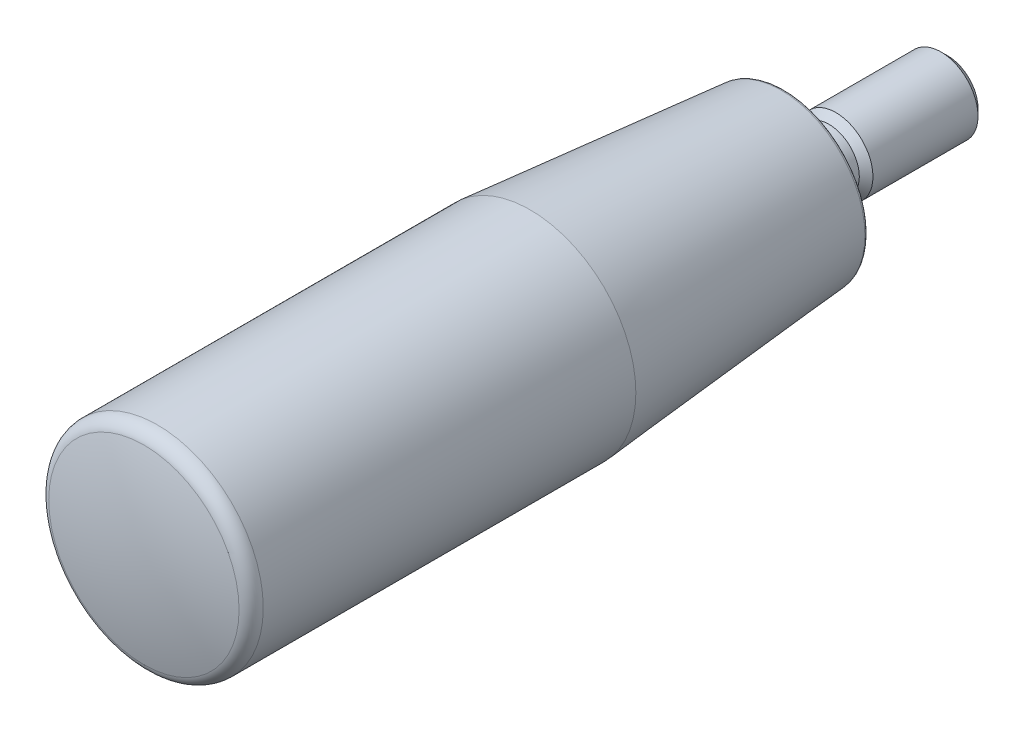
ISO-10303-21;
HEADER;
FILE_DESCRIPTION(('STEP AP214'),'2;1');
FILE_NAME('part.step','',(''),(''),'','','');
FILE_SCHEMA(('AUTOMOTIVE_DESIGN { 1 0 10303 214 1 1 1 1 }'));
ENDSEC;
DATA;
#1=APPLICATION_CONTEXT('core data for automotive mechanical design processes');
#2=APPLICATION_PROTOCOL_DEFINITION('international standard','automotive_design',2000,#1);
#3=PRODUCT_CONTEXT('',#1,'mechanical');
#4=PRODUCT('Part','Part','',(#3));
#5=PRODUCT_RELATED_PRODUCT_CATEGORY('part','',(#4));
#6=PRODUCT_DEFINITION_FORMATION('','',#4);
#7=PRODUCT_DEFINITION_CONTEXT('part definition',#1,'design');
#8=PRODUCT_DEFINITION('design','',#6,#7);
#9=PRODUCT_DEFINITION_SHAPE('','',#8);
#10=(LENGTH_UNIT() NAMED_UNIT(*) SI_UNIT(.MILLI.,.METRE.));
#11=(NAMED_UNIT(*) PLANE_ANGLE_UNIT() SI_UNIT($,.RADIAN.));
#12=(NAMED_UNIT(*) SI_UNIT($,.STERADIAN.) SOLID_ANGLE_UNIT());
#13=UNCERTAINTY_MEASURE_WITH_UNIT(LENGTH_MEASURE(1.E-05),#10,'distance_accuracy_value','');
#14=(GEOMETRIC_REPRESENTATION_CONTEXT(3) GLOBAL_UNCERTAINTY_ASSIGNED_CONTEXT((#13)) GLOBAL_UNIT_ASSIGNED_CONTEXT((#10,
#11,#12)) REPRESENTATION_CONTEXT('',''));
#15=CARTESIAN_POINT('',(0.,0.,0.));
#16=DIRECTION('',(0.,0.,1.));
#17=DIRECTION('',(1.,0.,0.));
#18=AXIS2_PLACEMENT_3D('',#15,#16,#17);
#19=CARTESIAN_POINT('',(0.,0.,-20.));
#20=DIRECTION('',(0.,0.,1.));
#21=DIRECTION('',(1.,0.,0.));
#22=AXIS2_PLACEMENT_3D('',#19,#20,#21);
#23=PLANE('',#22);
#24=CARTESIAN_POINT('',(0.,0.,-20.));
#25=DIRECTION('',(0.,0.,1.));
#26=DIRECTION('',(1.,0.,0.));
#27=AXIS2_PLACEMENT_3D('',#24,#25,#26);
#28=CIRCLE('',#27,4.08);
#29=CARTESIAN_POINT('',(4.08,0.,-20.));
#30=VERTEX_POINT('',#29);
#31=EDGE_CURVE('E130',#30,#30,#28,.T.);
#32=ORIENTED_EDGE('',*,*,#31,.F.);
#33=EDGE_LOOP('',(#32));
#34=FACE_BOUND('',#33,.T.);
#35=DIRECTION('',(-0.866025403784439,-0.5,0.));
#36=VECTOR('',#35,1.);
#37=CARTESIAN_POINT('',(1.25,-2.1650635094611,-20.));
#38=LINE('',#37,#36);
#39=CARTESIAN_POINT('',(2.5,-1.44337567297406,-20.));
#40=VERTEX_POINT('',#39);
#41=CARTESIAN_POINT('',(0.,-2.88675134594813,-20.));
#42=VERTEX_POINT('',#41);
#43=EDGE_CURVE('E9',#40,#42,#38,.T.);
#44=ORIENTED_EDGE('',*,*,#43,.F.);
#45=DIRECTION('',(0.,-1.,0.));
#46=VECTOR('',#45,1.);
#47=CARTESIAN_POINT('',(2.5,0.,-20.));
#48=LINE('',#47,#46);
#49=CARTESIAN_POINT('',(2.5,1.44337567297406,-20.));
#50=VERTEX_POINT('',#49);
#51=EDGE_CURVE('E78',#50,#40,#48,.T.);
#52=ORIENTED_EDGE('',*,*,#51,.F.);
#53=DIRECTION('',(0.866025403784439,-0.5,0.));
#54=VECTOR('',#53,1.);
#55=CARTESIAN_POINT('',(1.25,2.1650635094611,-20.));
#56=LINE('',#55,#54);
#57=CARTESIAN_POINT('',(0.,2.88675134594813,-20.));
#58=VERTEX_POINT('',#57);
#59=EDGE_CURVE('E134',#58,#50,#56,.T.);
#60=ORIENTED_EDGE('',*,*,#59,.F.);
#61=DIRECTION('',(0.866025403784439,0.5,0.));
#62=VECTOR('',#61,1.);
#63=CARTESIAN_POINT('',(-1.25,2.1650635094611,-20.));
#64=LINE('',#63,#62);
#65=CARTESIAN_POINT('',(-2.5,1.44337567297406,-20.));
#66=VERTEX_POINT('',#65);
#67=EDGE_CURVE('E136',#66,#58,#64,.T.);
#68=ORIENTED_EDGE('',*,*,#67,.F.);
#69=DIRECTION('',(0.,1.,0.));
#70=VECTOR('',#69,1.);
#71=CARTESIAN_POINT('',(-2.5,0.,-20.));
#72=LINE('',#71,#70);
#73=CARTESIAN_POINT('',(-2.5,-1.44337567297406,-20.));
#74=VERTEX_POINT('',#73);
#75=EDGE_CURVE('E138',#74,#66,#72,.T.);
#76=ORIENTED_EDGE('',*,*,#75,.F.);
#77=DIRECTION('',(-0.866025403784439,0.5,0.));
#78=VECTOR('',#77,1.);
#79=CARTESIAN_POINT('',(-1.25,-2.1650635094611,-20.));
#80=LINE('',#79,#78);
#81=EDGE_CURVE('E21',#42,#74,#80,.T.);
#82=ORIENTED_EDGE('',*,*,#81,.F.);
#83=EDGE_LOOP('',(#44,#52,#60,#68,#76,#82));
#84=FACE_BOUND('',#83,.T.);
#85=ADVANCED_FACE('F14',(#34,#84),#23,.F.);
#86=CARTESIAN_POINT('',(0.,0.,-20.));
#87=DIRECTION('',(0.,0.,1.));
#88=DIRECTION('',(1.,0.,0.));
#89=AXIS2_PLACEMENT_3D('',#86,#87,#88);
#90=CONICAL_SURFACE('',#89,4.08,0.785398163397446);
#91=CARTESIAN_POINT('',(0.,0.,-19.08));
#92=DIRECTION('',(0.,0.,1.));
#93=DIRECTION('',(1.,0.,0.));
#94=AXIS2_PLACEMENT_3D('',#91,#92,#93);
#95=CIRCLE('',#94,5.);
#96=CARTESIAN_POINT('',(5.,0.,-19.08));
#97=VERTEX_POINT('',#96);
#98=EDGE_CURVE('E127',#97,#97,#95,.T.);
#99=ORIENTED_EDGE('',*,*,#98,.F.);
#100=EDGE_LOOP('',(#99));
#101=FACE_BOUND('',#100,.T.);
#102=ORIENTED_EDGE('',*,*,#31,.T.);
#103=EDGE_LOOP('',(#102));
#104=FACE_BOUND('',#103,.T.);
#105=ADVANCED_FACE('F171',(#101,#104),#90,.T.);
#106=CARTESIAN_POINT('',(0.,0.,90.));
#107=DIRECTION('',(0.,0.,1.));
#108=DIRECTION('',(1.,0.,0.));
#109=AXIS2_PLACEMENT_3D('',#106,#107,#108);
#110=CYLINDRICAL_SURFACE('',#109,5.);
#111=CARTESIAN_POINT('',(0.,0.,-4.92));
#112=DIRECTION('',(0.,0.,1.));
#113=DIRECTION('',(1.,0.,0.));
#114=AXIS2_PLACEMENT_3D('',#111,#112,#113);
#115=CIRCLE('',#114,5.);
#116=CARTESIAN_POINT('',(5.,0.,-4.92));
#117=VERTEX_POINT('',#116);
#118=EDGE_CURVE('E124',#117,#117,#115,.T.);
#119=ORIENTED_EDGE('',*,*,#118,.F.);
#120=EDGE_LOOP('',(#119));
#121=FACE_BOUND('',#120,.T.);
#122=ORIENTED_EDGE('',*,*,#98,.T.);
#123=EDGE_LOOP('',(#122));
#124=FACE_BOUND('',#123,.T.);
#125=ADVANCED_FACE('F176',(#121,#124),#110,.T.);
#126=CARTESIAN_POINT('',(0.,0.,-4.92));
#127=DIRECTION('',(0.,0.,-1.));
#128=DIRECTION('',(-1.,0.,0.));
#129=AXIS2_PLACEMENT_3D('',#126,#127,#128);
#130=CONICAL_SURFACE('',#129,5.,0.785398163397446);
#131=CARTESIAN_POINT('',(0.,0.,-4.));
#132=DIRECTION('',(0.,0.,1.));
#133=DIRECTION('',(1.,0.,0.));
#134=AXIS2_PLACEMENT_3D('',#131,#132,#133);
#135=CIRCLE('',#134,4.08);
#136=CARTESIAN_POINT('',(4.08,0.,-4.));
#137=VERTEX_POINT('',#136);
#138=EDGE_CURVE('E121',#137,#137,#135,.T.);
#139=ORIENTED_EDGE('',*,*,#138,.F.);
#140=EDGE_LOOP('',(#139));
#141=FACE_BOUND('',#140,.T.);
#142=ORIENTED_EDGE('',*,*,#118,.T.);
#143=EDGE_LOOP('',(#142));
#144=FACE_BOUND('',#143,.T.);
#145=ADVANCED_FACE('F183',(#141,#144),#130,.T.);
#146=CARTESIAN_POINT('',(0.,0.,90.));
#147=DIRECTION('',(0.,0.,1.));
#148=DIRECTION('',(1.,0.,0.));
#149=AXIS2_PLACEMENT_3D('',#146,#147,#148);
#150=CYLINDRICAL_SURFACE('',#149,4.08);
#151=CARTESIAN_POINT('',(0.,0.,0.));
#152=DIRECTION('',(0.,0.,1.));
#153=DIRECTION('',(1.,0.,0.));
#154=AXIS2_PLACEMENT_3D('',#151,#152,#153);
#155=CIRCLE('',#154,4.08);
#156=CARTESIAN_POINT('',(4.08,0.,0.));
#157=VERTEX_POINT('',#156);
#158=EDGE_CURVE('E118',#157,#157,#155,.T.);
#159=ORIENTED_EDGE('',*,*,#158,.F.);
#160=EDGE_LOOP('',(#159));
#161=FACE_BOUND('',#160,.T.);
#162=ORIENTED_EDGE('',*,*,#138,.T.);
#163=EDGE_LOOP('',(#162));
#164=FACE_BOUND('',#163,.T.);
#165=ADVANCED_FACE('F190',(#161,#164),#150,.T.);
#166=CARTESIAN_POINT('',(0.,4.08,0.));
#167=DIRECTION('',(0.,0.,1.));
#168=DIRECTION('',(1.,0.,0.));
#169=AXIS2_PLACEMENT_3D('',#166,#167,#168);
#170=PLANE('',#169);
#171=CARTESIAN_POINT('',(0.,0.,0.));
#172=DIRECTION('',(0.,0.,1.));
#173=DIRECTION('',(1.,0.,0.));
#174=AXIS2_PLACEMENT_3D('',#171,#172,#173);
#175=CIRCLE('',#174,6.);
#176=CARTESIAN_POINT('',(6.,0.,0.));
#177=VERTEX_POINT('',#176);
#178=EDGE_CURVE('E115',#177,#177,#175,.T.);
#179=ORIENTED_EDGE('',*,*,#178,.F.);
#180=EDGE_LOOP('',(#179));
#181=FACE_BOUND('',#180,.T.);
#182=ORIENTED_EDGE('',*,*,#158,.T.);
#183=EDGE_LOOP('',(#182));
#184=FACE_BOUND('',#183,.T.);
#185=ADVANCED_FACE('F194',(#181,#184),#170,.F.);
#186=CARTESIAN_POINT('',(0.,0.,90.));
#187=DIRECTION('',(0.,0.,1.));
#188=DIRECTION('',(1.,0.,0.));
#189=AXIS2_PLACEMENT_3D('',#186,#187,#188);
#190=CYLINDRICAL_SURFACE('',#189,6.);
#191=CARTESIAN_POINT('',(0.,0.,2.));
#192=DIRECTION('',(0.,0.,1.));
#193=DIRECTION('',(1.,0.,0.));
#194=AXIS2_PLACEMENT_3D('',#191,#192,#193);
#195=CIRCLE('',#194,6.);
#196=CARTESIAN_POINT('',(6.,0.,2.));
#197=VERTEX_POINT('',#196);
#198=EDGE_CURVE('E112',#197,#197,#195,.T.);
#199=ORIENTED_EDGE('',*,*,#198,.F.);
#200=EDGE_LOOP('',(#199));
#201=FACE_BOUND('',#200,.T.);
#202=ORIENTED_EDGE('',*,*,#178,.T.);
#203=EDGE_LOOP('',(#202));
#204=FACE_BOUND('',#203,.T.);
#205=ADVANCED_FACE('F198',(#201,#204),#190,.T.);
#206=CARTESIAN_POINT('',(0.,6.,2.));
#207=DIRECTION('',(0.,0.,1.));
#208=DIRECTION('',(1.,0.,0.));
#209=AXIS2_PLACEMENT_3D('',#206,#207,#208);
#210=PLANE('',#209);
#211=CARTESIAN_POINT('',(0.,0.,2.));
#212=DIRECTION('',(0.,0.,1.));
#213=DIRECTION('',(1.,0.,0.));
#214=AXIS2_PLACEMENT_3D('',#211,#212,#213);
#215=CIRCLE('',#214,10.7918344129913);
#216=CARTESIAN_POINT('',(10.7918344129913,0.,2.));
#217=VERTEX_POINT('',#216);
#218=EDGE_CURVE('E109',#217,#217,#215,.T.);
#219=ORIENTED_EDGE('',*,*,#218,.F.);
#220=EDGE_LOOP('',(#219));
#221=FACE_BOUND('',#220,.T.);
#222=ORIENTED_EDGE('',*,*,#198,.T.);
#223=EDGE_LOOP('',(#222));
#224=FACE_BOUND('',#223,.T.);
#225=ADVANCED_FACE('F202',(#221,#224),#210,.F.);
#226=CARTESIAN_POINT('',(0.,0.,2.5));
#227=DIRECTION('',(0.,0.,1.));
#228=DIRECTION('',(1.,0.,0.));
#229=AXIS2_PLACEMENT_3D('',#226,#227,#228);
#230=TOROIDAL_SURFACE('',#229,10.7918344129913,0.499999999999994);
#231=ORIENTED_EDGE('',*,*,#218,.T.);
#232=EDGE_LOOP('',(#231));
#233=FACE_BOUND('',#232,.T.);
#234=CARTESIAN_POINT('',(0.,0.,2.45642212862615));
#235=DIRECTION('',(0.,0.,1.));
#236=DIRECTION('',(1.,0.,0.));
#237=AXIS2_PLACEMENT_3D('',#234,#235,#236);
#238=CIRCLE('',#237,11.2899317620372);
#239=CARTESIAN_POINT('',(11.2899317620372,0.,2.45642212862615));
#240=VERTEX_POINT('',#239);
#241=EDGE_CURVE('E106',#240,#240,#238,.T.);
#242=ORIENTED_EDGE('',*,*,#241,.F.);
#243=EDGE_LOOP('',(#242));
#244=FACE_BOUND('',#243,.T.);
#245=ADVANCED_FACE('F206',(#233,#244),#230,.T.);
#246=CARTESIAN_POINT('',(0.,0.,2.45642212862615));
#247=DIRECTION('',(0.,0.,1.));
#248=DIRECTION('',(1.,0.,0.));
#249=AXIS2_PLACEMENT_3D('',#246,#247,#248);
#250=CONICAL_SURFACE('',#249,11.2899317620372,0.0872664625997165);
#251=CARTESIAN_POINT('',(0.,0.,36.290156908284));
#252=DIRECTION('',(0.,0.,1.));
#253=DIRECTION('',(1.,0.,0.));
#254=AXIS2_PLACEMENT_3D('',#251,#252,#253);
#255=CIRCLE('',#254,14.25);
#256=CARTESIAN_POINT('',(14.25,0.,36.290156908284));
#257=VERTEX_POINT('',#256);
#258=EDGE_CURVE('E103',#257,#257,#255,.T.);
#259=ORIENTED_EDGE('',*,*,#258,.F.);
#260=EDGE_LOOP('',(#259));
#261=FACE_BOUND('',#260,.T.);
#262=ORIENTED_EDGE('',*,*,#241,.T.);
#263=EDGE_LOOP('',(#262));
#264=FACE_BOUND('',#263,.T.);
#265=ADVANCED_FACE('F210',(#261,#264),#250,.T.);
#266=CARTESIAN_POINT('',(0.,0.,90.));
#267=DIRECTION('',(0.,0.,1.));
#268=DIRECTION('',(1.,0.,0.));
#269=AXIS2_PLACEMENT_3D('',#266,#267,#268);
#270=CYLINDRICAL_SURFACE('',#269,14.25);
#271=CARTESIAN_POINT('',(0.,0.,86.51787530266));
#272=DIRECTION('',(0.,0.,1.));
#273=DIRECTION('',(1.,0.,0.));
#274=AXIS2_PLACEMENT_3D('',#271,#272,#273);
#275=CIRCLE('',#274,14.25);
#276=CARTESIAN_POINT('',(14.25,0.,86.51787530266));
#277=VERTEX_POINT('',#276);
#278=EDGE_CURVE('E100',#277,#277,#275,.T.);
#279=ORIENTED_EDGE('',*,*,#278,.F.);
#280=EDGE_LOOP('',(#279));
#281=FACE_BOUND('',#280,.T.);
#282=ORIENTED_EDGE('',*,*,#258,.T.);
#283=EDGE_LOOP('',(#282));
#284=FACE_BOUND('',#283,.T.);
#285=ADVANCED_FACE('F214',(#281,#284),#270,.T.);
#286=CARTESIAN_POINT('',(0.,0.,86.51787530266));
#287=DIRECTION('',(0.,0.,1.));
#288=DIRECTION('',(1.,0.,0.));
#289=AXIS2_PLACEMENT_3D('',#286,#287,#288);
#290=TOROIDAL_SURFACE('',#289,12.35,1.89999999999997);
#291=ORIENTED_EDGE('',*,*,#278,.T.);
#292=EDGE_LOOP('',(#291));
#293=FACE_BOUND('',#292,.T.);
#294=CARTESIAN_POINT('',(0.,0.,88.356518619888));
#295=DIRECTION('',(0.,0.,1.));
#296=DIRECTION('',(1.,0.,0.));
#297=AXIS2_PLACEMENT_3D('',#294,#295,#296);
#298=CIRCLE('',#297,12.8289475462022);
#299=CARTESIAN_POINT('',(12.8289475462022,0.,88.356518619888));
#300=VERTEX_POINT('',#299);
#301=EDGE_CURVE('E97',#300,#300,#298,.T.);
#302=ORIENTED_EDGE('',*,*,#301,.F.);
#303=EDGE_LOOP('',(#302));
#304=FACE_BOUND('',#303,.T.);
#305=ADVANCED_FACE('F218',(#293,#304),#290,.T.);
#306=CARTESIAN_POINT('',(0.,1.96023752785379E-13,39.1071428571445));
#307=DIRECTION('',(0.,0.,1.));
#308=DIRECTION('',(0.,-1.,0.));
#309=AXIS2_PLACEMENT_3D('',#306,#307,#308);
#310=SPHERICAL_SURFACE('',#309,50.8928571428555);
#311=ORIENTED_EDGE('',*,*,#301,.T.);
#312=EDGE_LOOP('',(#311));
#313=FACE_BOUND('',#312,.T.);
#314=ADVANCED_FACE('F222',(#313),#310,.T.);
#315=CARTESIAN_POINT('',(2.5,-1.44337567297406,-25.));
#316=DIRECTION('',(-0.5,0.866025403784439,0.));
#317=DIRECTION('',(-0.866025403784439,-0.5,0.));
#318=AXIS2_PLACEMENT_3D('',#315,#316,#317);
#319=PLANE('',#318);
#320=ORIENTED_EDGE('',*,*,#43,.T.);
#321=DIRECTION('',(0.,0.,1.));
#322=VECTOR('',#321,1.);
#323=CARTESIAN_POINT('',(0.,-2.88675134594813,-25.));
#324=LINE('',#323,#322);
#325=CARTESIAN_POINT('',(0.,-2.88675134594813,-15.));
#326=VERTEX_POINT('',#325);
#327=EDGE_CURVE('E67',#42,#326,#324,.T.);
#328=ORIENTED_EDGE('',*,*,#327,.T.);
#329=DIRECTION('',(-0.866025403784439,-0.5,0.));
#330=VECTOR('',#329,1.);
#331=CARTESIAN_POINT('',(2.5,-1.44337567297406,-15.));
#332=LINE('',#331,#330);
#333=CARTESIAN_POINT('',(2.5,-1.44337567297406,-15.));
#334=VERTEX_POINT('',#333);
#335=EDGE_CURVE('E63',#334,#326,#332,.T.);
#336=ORIENTED_EDGE('',*,*,#335,.F.);
#337=DIRECTION('',(0.,0.,1.));
#338=VECTOR('',#337,1.);
#339=CARTESIAN_POINT('',(2.5,-1.44337567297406,-25.));
#340=LINE('',#339,#338);
#341=EDGE_CURVE('E66',#40,#334,#340,.T.);
#342=ORIENTED_EDGE('',*,*,#341,.F.);
#343=EDGE_LOOP('',(#320,#328,#336,#342));
#344=FACE_BOUND('',#343,.T.);
#345=ADVANCED_FACE('F65',(#344),#319,.T.);
#346=CARTESIAN_POINT('',(0.,-2.88675134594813,-25.));
#347=DIRECTION('',(0.5,0.866025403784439,0.));
#348=DIRECTION('',(-0.866025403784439,0.5,0.));
#349=AXIS2_PLACEMENT_3D('',#346,#347,#348);
#350=PLANE('',#349);
#351=ORIENTED_EDGE('',*,*,#81,.T.);
#352=DIRECTION('',(0.,0.,1.));
#353=VECTOR('',#352,1.);
#354=CARTESIAN_POINT('',(-2.5,-1.44337567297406,-25.));
#355=LINE('',#354,#353);
#356=CARTESIAN_POINT('',(-2.5,-1.44337567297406,-15.));
#357=VERTEX_POINT('',#356);
#358=EDGE_CURVE('E94',#74,#357,#355,.T.);
#359=ORIENTED_EDGE('',*,*,#358,.T.);
#360=DIRECTION('',(-0.866025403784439,0.5,0.));
#361=VECTOR('',#360,1.);
#362=CARTESIAN_POINT('',(0.,-2.88675134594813,-15.));
#363=LINE('',#362,#361);
#364=EDGE_CURVE('E72',#326,#357,#363,.T.);
#365=ORIENTED_EDGE('',*,*,#364,.F.);
#366=ORIENTED_EDGE('',*,*,#327,.F.);
#367=EDGE_LOOP('',(#351,#359,#365,#366));
#368=FACE_BOUND('',#367,.T.);
#369=ADVANCED_FACE('F142',(#368),#350,.T.);
#370=CARTESIAN_POINT('',(-2.5,-1.44337567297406,-25.));
#371=DIRECTION('',(1.,0.,0.));
#372=DIRECTION('',(0.,0.,-1.));
#373=AXIS2_PLACEMENT_3D('',#370,#371,#372);
#374=PLANE('',#373);
#375=ORIENTED_EDGE('',*,*,#75,.T.);
#376=DIRECTION('',(0.,0.,1.));
#377=VECTOR('',#376,1.);
#378=CARTESIAN_POINT('',(-2.5,1.44337567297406,-25.));
#379=LINE('',#378,#377);
#380=CARTESIAN_POINT('',(-2.5,1.44337567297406,-15.));
#381=VERTEX_POINT('',#380);
#382=EDGE_CURVE('E92',#66,#381,#379,.T.);
#383=ORIENTED_EDGE('',*,*,#382,.T.);
#384=DIRECTION('',(0.,1.,0.));
#385=VECTOR('',#384,1.);
#386=CARTESIAN_POINT('',(-2.5,-1.44337567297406,-15.));
#387=LINE('',#386,#385);
#388=EDGE_CURVE('E150',#357,#381,#387,.T.);
#389=ORIENTED_EDGE('',*,*,#388,.F.);
#390=ORIENTED_EDGE('',*,*,#358,.F.);
#391=EDGE_LOOP('',(#375,#383,#389,#390));
#392=FACE_BOUND('',#391,.T.);
#393=ADVANCED_FACE('F147',(#392),#374,.T.);
#394=CARTESIAN_POINT('',(-2.5,1.44337567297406,-25.));
#395=DIRECTION('',(0.5,-0.866025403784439,0.));
#396=DIRECTION('',(0.866025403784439,0.5,0.));
#397=AXIS2_PLACEMENT_3D('',#394,#395,#396);
#398=PLANE('',#397);
#399=ORIENTED_EDGE('',*,*,#67,.T.);
#400=DIRECTION('',(0.,0.,1.));
#401=VECTOR('',#400,1.);
#402=CARTESIAN_POINT('',(0.,2.88675134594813,-25.));
#403=LINE('',#402,#401);
#404=CARTESIAN_POINT('',(0.,2.88675134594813,-15.));
#405=VERTEX_POINT('',#404);
#406=EDGE_CURVE('E90',#58,#405,#403,.T.);
#407=ORIENTED_EDGE('',*,*,#406,.T.);
#408=DIRECTION('',(0.866025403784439,0.5,0.));
#409=VECTOR('',#408,1.);
#410=CARTESIAN_POINT('',(-2.5,1.44337567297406,-15.));
#411=LINE('',#410,#409);
#412=EDGE_CURVE('E85',#381,#405,#411,.T.);
#413=ORIENTED_EDGE('',*,*,#412,.F.);
#414=ORIENTED_EDGE('',*,*,#382,.F.);
#415=EDGE_LOOP('',(#399,#407,#413,#414));
#416=FACE_BOUND('',#415,.T.);
#417=ADVANCED_FACE('F155',(#416),#398,.T.);
#418=CARTESIAN_POINT('',(0.,2.88675134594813,-25.));
#419=DIRECTION('',(-0.5,-0.866025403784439,0.));
#420=DIRECTION('',(0.866025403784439,-0.5,0.));
#421=AXIS2_PLACEMENT_3D('',#418,#419,#420);
#422=PLANE('',#421);
#423=ORIENTED_EDGE('',*,*,#59,.T.);
#424=DIRECTION('',(0.,0.,1.));
#425=VECTOR('',#424,1.);
#426=CARTESIAN_POINT('',(2.5,1.44337567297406,-25.));
#427=LINE('',#426,#425);
#428=CARTESIAN_POINT('',(2.5,1.44337567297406,-15.));
#429=VERTEX_POINT('',#428);
#430=EDGE_CURVE('E28',#50,#429,#427,.T.);
#431=ORIENTED_EDGE('',*,*,#430,.T.);
#432=DIRECTION('',(0.866025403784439,-0.5,0.));
#433=VECTOR('',#432,1.);
#434=CARTESIAN_POINT('',(0.,2.88675134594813,-15.));
#435=LINE('',#434,#433);
#436=EDGE_CURVE('E83',#405,#429,#435,.T.);
#437=ORIENTED_EDGE('',*,*,#436,.F.);
#438=ORIENTED_EDGE('',*,*,#406,.F.);
#439=EDGE_LOOP('',(#423,#431,#437,#438));
#440=FACE_BOUND('',#439,.T.);
#441=ADVANCED_FACE('F158',(#440),#422,.T.);
#442=CARTESIAN_POINT('',(2.5,1.44337567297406,-25.));
#443=DIRECTION('',(-1.,0.,0.));
#444=DIRECTION('',(0.,0.,1.));
#445=AXIS2_PLACEMENT_3D('',#442,#443,#444);
#446=PLANE('',#445);
#447=ORIENTED_EDGE('',*,*,#51,.T.);
#448=ORIENTED_EDGE('',*,*,#341,.T.);
#449=DIRECTION('',(0.,-1.,0.));
#450=VECTOR('',#449,1.);
#451=CARTESIAN_POINT('',(2.5,1.44337567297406,-15.));
#452=LINE('',#451,#450);
#453=EDGE_CURVE('E75',#429,#334,#452,.T.);
#454=ORIENTED_EDGE('',*,*,#453,.F.);
#455=ORIENTED_EDGE('',*,*,#430,.F.);
#456=EDGE_LOOP('',(#447,#448,#454,#455));
#457=FACE_BOUND('',#456,.T.);
#458=ADVANCED_FACE('F74',(#457),#446,.T.);
#459=CARTESIAN_POINT('',(0.,0.,-15.));
#460=DIRECTION('',(0.,0.,-1.));
#461=DIRECTION('',(-1.,0.,0.));
#462=AXIS2_PLACEMENT_3D('',#459,#460,#461);
#463=PLANE('',#462);
#464=ORIENTED_EDGE('',*,*,#453,.T.);
#465=ORIENTED_EDGE('',*,*,#335,.T.);
#466=ORIENTED_EDGE('',*,*,#364,.T.);
#467=ORIENTED_EDGE('',*,*,#388,.T.);
#468=ORIENTED_EDGE('',*,*,#412,.T.);
#469=ORIENTED_EDGE('',*,*,#436,.T.);
#470=EDGE_LOOP('',(#464,#465,#466,#467,#468,#469));
#471=FACE_BOUND('',#470,.T.);
#472=ADVANCED_FACE('F80',(#471),#463,.T.);
#473=CLOSED_SHELL('',(#85,#105,#125,#145,#165,#185,#205,#225,#245,#265,#285,#305,#314,#345,#369,
#393,#417,#441,#458,#472));
#474=MANIFOLD_SOLID_BREP('B1',#473);
#475=ADVANCED_BREP_SHAPE_REPRESENTATION('',(#18,#474),#14);
#476=SHAPE_DEFINITION_REPRESENTATION(#9,#475);
ENDSEC;
END-ISO-10303-21;
